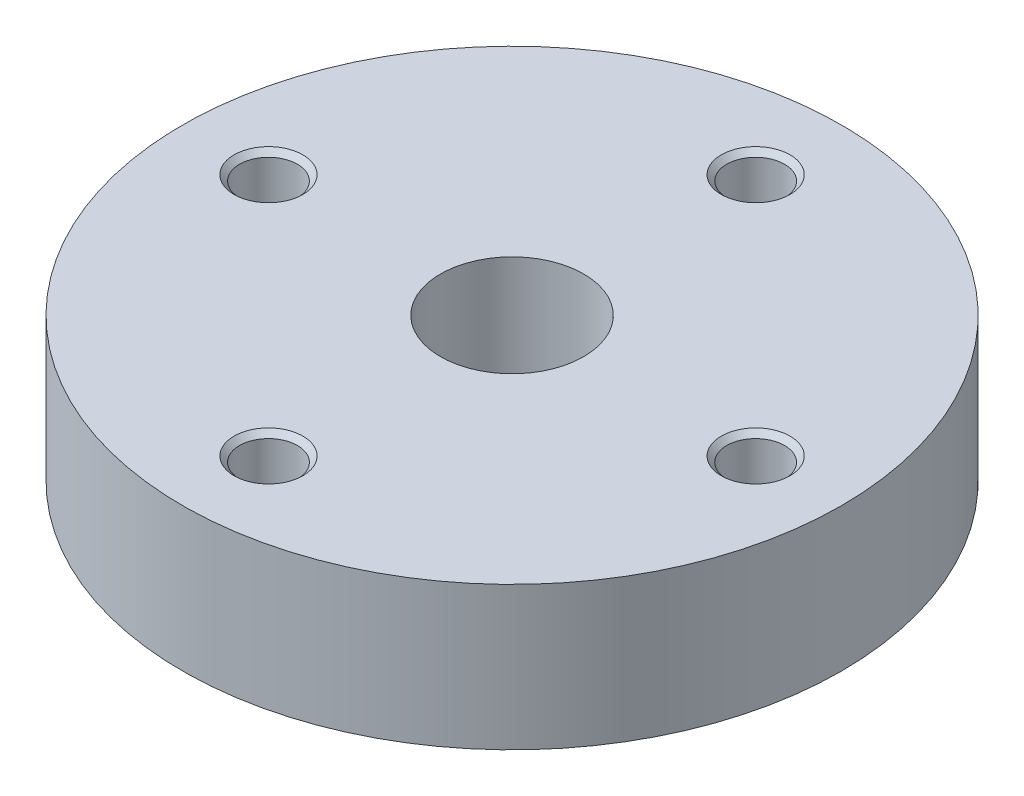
ISO-10303-21;
HEADER;
FILE_DESCRIPTION(('STEP AP214'),'2;1');
FILE_NAME('part.step','',(''),(''),'','','');
FILE_SCHEMA(('AUTOMOTIVE_DESIGN { 1 0 10303 214 1 1 1 1 }'));
ENDSEC;
DATA;
#1=APPLICATION_CONTEXT('core data for automotive mechanical design processes');
#2=APPLICATION_PROTOCOL_DEFINITION('international standard','automotive_design',2000,#1);
#3=PRODUCT_CONTEXT('',#1,'mechanical');
#4=PRODUCT('Part','Part','',(#3));
#5=PRODUCT_RELATED_PRODUCT_CATEGORY('part','',(#4));
#6=PRODUCT_DEFINITION_FORMATION('','',#4);
#7=PRODUCT_DEFINITION_CONTEXT('part definition',#1,'design');
#8=PRODUCT_DEFINITION('design','',#6,#7);
#9=PRODUCT_DEFINITION_SHAPE('','',#8);
#10=(LENGTH_UNIT() NAMED_UNIT(*) SI_UNIT(.MILLI.,.METRE.));
#11=(NAMED_UNIT(*) PLANE_ANGLE_UNIT() SI_UNIT($,.RADIAN.));
#12=(NAMED_UNIT(*) SI_UNIT($,.STERADIAN.) SOLID_ANGLE_UNIT());
#13=UNCERTAINTY_MEASURE_WITH_UNIT(LENGTH_MEASURE(1.E-05),#10,'distance_accuracy_value','');
#14=(GEOMETRIC_REPRESENTATION_CONTEXT(3) GLOBAL_UNCERTAINTY_ASSIGNED_CONTEXT((#13)) GLOBAL_UNIT_ASSIGNED_CONTEXT((#10,
#11,#12)) REPRESENTATION_CONTEXT('',''));
#15=CARTESIAN_POINT('',(0.,0.,0.));
#16=DIRECTION('',(0.,0.,1.));
#17=DIRECTION('',(1.,0.,0.));
#18=AXIS2_PLACEMENT_3D('',#15,#16,#17);
#19=CARTESIAN_POINT('',(0.,12.5,0.));
#20=DIRECTION('',(0.,-1.,0.));
#21=DIRECTION('',(1.,0.,0.));
#22=AXIS2_PLACEMENT_3D('',#19,#20,#21);
#23=CYLINDRICAL_SURFACE('',#22,57.5);
#24=CARTESIAN_POINT('',(0.,0.,0.));
#25=DIRECTION('',(0.,1.,0.));
#26=DIRECTION('',(1.,0.,0.));
#27=AXIS2_PLACEMENT_3D('',#24,#25,#26);
#28=CIRCLE('',#27,57.5);
#29=CARTESIAN_POINT('',(57.5,0.,0.));
#30=VERTEX_POINT('',#29);
#31=EDGE_CURVE('E9',#30,#30,#28,.T.);
#32=ORIENTED_EDGE('',*,*,#31,.T.);
#33=EDGE_LOOP('',(#32));
#34=FACE_BOUND('',#33,.T.);
#35=CARTESIAN_POINT('',(0.,25.,0.));
#36=DIRECTION('',(0.,1.,0.));
#37=DIRECTION('',(1.,0.,0.));
#38=AXIS2_PLACEMENT_3D('',#35,#36,#37);
#39=CIRCLE('',#38,57.5);
#40=CARTESIAN_POINT('',(57.5,25.,0.));
#41=VERTEX_POINT('',#40);
#42=EDGE_CURVE('E111',#41,#41,#39,.T.);
#43=ORIENTED_EDGE('',*,*,#42,.F.);
#44=EDGE_LOOP('',(#43));
#45=FACE_BOUND('',#44,.T.);
#46=ADVANCED_FACE('F15',(#34,#45),#23,.T.);
#47=CARTESIAN_POINT('',(35.,0.,0.));
#48=DIRECTION('',(0.,-1.,0.));
#49=DIRECTION('',(-1.,0.,0.));
#50=AXIS2_PLACEMENT_3D('',#47,#48,#49);
#51=PLANE('',#50);
#52=CARTESIAN_POINT('',(0.,0.,0.));
#53=DIRECTION('',(0.,1.,0.));
#54=DIRECTION('',(1.,0.,0.));
#55=AXIS2_PLACEMENT_3D('',#52,#53,#54);
#56=CIRCLE('',#55,12.5);
#57=CARTESIAN_POINT('',(12.5,0.,0.));
#58=VERTEX_POINT('',#57);
#59=EDGE_CURVE('E25',#58,#58,#56,.T.);
#60=ORIENTED_EDGE('',*,*,#59,.T.);
#61=EDGE_LOOP('',(#60));
#62=FACE_BOUND('',#61,.T.);
#63=ORIENTED_EDGE('',*,*,#31,.F.);
#64=EDGE_LOOP('',(#63));
#65=FACE_BOUND('',#64,.T.);
#66=ADVANCED_FACE('F203',(#62,#65),#51,.T.);
#67=CARTESIAN_POINT('',(0.,12.5,0.));
#68=DIRECTION('',(0.,-1.,0.));
#69=DIRECTION('',(1.,0.,0.));
#70=AXIS2_PLACEMENT_3D('',#67,#68,#69);
#71=CYLINDRICAL_SURFACE('',#70,12.5);
#72=CARTESIAN_POINT('',(0.,25.,0.));
#73=DIRECTION('',(0.,1.,0.));
#74=DIRECTION('',(1.,0.,0.));
#75=AXIS2_PLACEMENT_3D('',#72,#73,#74);
#76=CIRCLE('',#75,12.5);
#77=CARTESIAN_POINT('',(12.5,25.,0.));
#78=VERTEX_POINT('',#77);
#79=EDGE_CURVE('E107',#78,#78,#76,.T.);
#80=ORIENTED_EDGE('',*,*,#79,.T.);
#81=EDGE_LOOP('',(#80));
#82=FACE_BOUND('',#81,.T.);
#83=ORIENTED_EDGE('',*,*,#59,.F.);
#84=EDGE_LOOP('',(#83));
#85=FACE_BOUND('',#84,.T.);
#86=ADVANCED_FACE('F108',(#82,#85),#71,.F.);
#87=CARTESIAN_POINT('',(35.,25.,0.));
#88=DIRECTION('',(0.,1.,0.));
#89=DIRECTION('',(1.,0.,0.));
#90=AXIS2_PLACEMENT_3D('',#87,#88,#89);
#91=PLANE('',#90);
#92=ORIENTED_EDGE('',*,*,#42,.T.);
#93=EDGE_LOOP('',(#92));
#94=FACE_BOUND('',#93,.T.);
#95=ORIENTED_EDGE('',*,*,#79,.F.);
#96=EDGE_LOOP('',(#95));
#97=FACE_BOUND('',#96,.T.);
#98=CARTESIAN_POINT('',(42.5,25.,0.));
#99=DIRECTION('',(0.,-1.,0.));
#100=DIRECTION('',(1.,0.,0.));
#101=AXIS2_PLACEMENT_3D('',#98,#99,#100);
#102=CIRCLE('',#101,6.);
#103=CARTESIAN_POINT('',(48.5,25.,0.));
#104=VERTEX_POINT('',#103);
#105=EDGE_CURVE('E130',#104,#104,#102,.T.);
#106=ORIENTED_EDGE('',*,*,#105,.T.);
#107=EDGE_LOOP('',(#106));
#108=FACE_BOUND('',#107,.T.);
#109=CARTESIAN_POINT('',(0.,25.,-42.5));
#110=DIRECTION('',(0.,-1.,0.));
#111=DIRECTION('',(0.,0.,-1.));
#112=AXIS2_PLACEMENT_3D('',#109,#110,#111);
#113=CIRCLE('',#112,6.);
#114=CARTESIAN_POINT('',(0.,25.,-48.5));
#115=VERTEX_POINT('',#114);
#116=EDGE_CURVE('E147',#115,#115,#113,.T.);
#117=ORIENTED_EDGE('',*,*,#116,.T.);
#118=EDGE_LOOP('',(#117));
#119=FACE_BOUND('',#118,.T.);
#120=CARTESIAN_POINT('',(-42.5,25.,0.));
#121=DIRECTION('',(0.,-1.,0.));
#122=DIRECTION('',(-1.,0.,0.));
#123=AXIS2_PLACEMENT_3D('',#120,#121,#122);
#124=CIRCLE('',#123,6.);
#125=CARTESIAN_POINT('',(-48.5,25.,0.));
#126=VERTEX_POINT('',#125);
#127=EDGE_CURVE('E146',#126,#126,#124,.T.);
#128=ORIENTED_EDGE('',*,*,#127,.T.);
#129=EDGE_LOOP('',(#128));
#130=FACE_BOUND('',#129,.T.);
#131=CARTESIAN_POINT('',(0.,25.,42.5));
#132=DIRECTION('',(0.,-1.,0.));
#133=DIRECTION('',(0.,0.,1.));
#134=AXIS2_PLACEMENT_3D('',#131,#132,#133);
#135=CIRCLE('',#134,6.);
#136=CARTESIAN_POINT('',(0.,25.,48.5));
#137=VERTEX_POINT('',#136);
#138=EDGE_CURVE('E119',#137,#137,#135,.T.);
#139=ORIENTED_EDGE('',*,*,#138,.T.);
#140=EDGE_LOOP('',(#139));
#141=FACE_BOUND('',#140,.T.);
#142=ADVANCED_FACE('F192',(#94,#97,#108,#119,#130,#141),#91,.T.);
#143=CARTESIAN_POINT('',(42.5,5.54137867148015,0.));
#144=DIRECTION('',(0.,1.,0.));
#145=DIRECTION('',(1.,0.,0.));
#146=AXIS2_PLACEMENT_3D('',#143,#144,#145);
#147=CONICAL_SURFACE('',#146,2.52640625,1.0471975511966);
#148=CARTESIAN_POINT('',(42.5,7.,0.));
#149=DIRECTION('',(0.,-1.,0.));
#150=DIRECTION('',(1.,0.,0.));
#151=AXIS2_PLACEMENT_3D('',#148,#149,#150);
#152=CIRCLE('',#151,5.0528125);
#153=CARTESIAN_POINT('',(47.5528125,7.,0.));
#154=VERTEX_POINT('',#153);
#155=EDGE_CURVE('E112',#154,#154,#152,.T.);
#156=ORIENTED_EDGE('',*,*,#155,.F.);
#157=EDGE_LOOP('',(#156));
#158=FACE_BOUND('',#157,.T.);
#159=CARTESIAN_POINT('',(42.5,4.08275734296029,0.));
#160=VERTEX_POINT('',#159);
#161=VERTEX_LOOP('',#160);
#162=FACE_BOUND('',#161,.T.);
#163=ADVANCED_FACE('F186',(#158,#162),#147,.F.);
#164=CARTESIAN_POINT('',(42.5,9.52640625,0.));
#165=DIRECTION('',(0.,1.,0.));
#166=DIRECTION('',(1.,0.,0.));
#167=AXIS2_PLACEMENT_3D('',#164,#165,#166);
#168=CYLINDRICAL_SURFACE('',#167,5.0528125);
#169=CARTESIAN_POINT('',(42.5,12.0528125,0.));
#170=DIRECTION('',(0.,-1.,0.));
#171=DIRECTION('',(1.,0.,0.));
#172=AXIS2_PLACEMENT_3D('',#169,#170,#171);
#173=CIRCLE('',#172,5.0528125);
#174=CARTESIAN_POINT('',(47.5528125,12.0528125,0.));
#175=VERTEX_POINT('',#174);
#176=EDGE_CURVE('E115',#175,#175,#173,.T.);
#177=ORIENTED_EDGE('',*,*,#176,.F.);
#178=EDGE_LOOP('',(#177));
#179=FACE_BOUND('',#178,.T.);
#180=ORIENTED_EDGE('',*,*,#155,.T.);
#181=EDGE_LOOP('',(#180));
#182=FACE_BOUND('',#181,.T.);
#183=ADVANCED_FACE('F179',(#179,#182),#168,.F.);
#184=CARTESIAN_POINT('',(42.5,12.52640625,0.));
#185=DIRECTION('',(0.,1.,0.));
#186=DIRECTION('',(1.,0.,0.));
#187=AXIS2_PLACEMENT_3D('',#184,#185,#186);
#188=CONICAL_SURFACE('',#187,5.52640625,0.785398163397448);
#189=CARTESIAN_POINT('',(42.5,13.,0.));
#190=DIRECTION('',(0.,-1.,0.));
#191=DIRECTION('',(1.,0.,0.));
#192=AXIS2_PLACEMENT_3D('',#189,#190,#191);
#193=CIRCLE('',#192,6.);
#194=CARTESIAN_POINT('',(48.5,13.,0.));
#195=VERTEX_POINT('',#194);
#196=EDGE_CURVE('E126',#195,#195,#193,.T.);
#197=ORIENTED_EDGE('',*,*,#196,.F.);
#198=EDGE_LOOP('',(#197));
#199=FACE_BOUND('',#198,.T.);
#200=ORIENTED_EDGE('',*,*,#176,.T.);
#201=EDGE_LOOP('',(#200));
#202=FACE_BOUND('',#201,.T.);
#203=ADVANCED_FACE('F176',(#199,#202),#188,.F.);
#204=CARTESIAN_POINT('',(48.02640625,13.,0.));
#205=DIRECTION('',(0.,1.,0.));
#206=DIRECTION('',(-1.,0.,0.));
#207=AXIS2_PLACEMENT_3D('',#204,#205,#206);
#208=PLANE('',#207);
#209=CARTESIAN_POINT('',(42.5,13.,0.));
#210=DIRECTION('',(0.,-1.,0.));
#211=DIRECTION('',(1.,0.,0.));
#212=AXIS2_PLACEMENT_3D('',#209,#210,#211);
#213=CIRCLE('',#212,5.0528125);
#214=CARTESIAN_POINT('',(47.5528125,13.,0.));
#215=VERTEX_POINT('',#214);
#216=EDGE_CURVE('E135',#215,#215,#213,.T.);
#217=ORIENTED_EDGE('',*,*,#216,.F.);
#218=EDGE_LOOP('',(#217));
#219=FACE_BOUND('',#218,.T.);
#220=ORIENTED_EDGE('',*,*,#196,.T.);
#221=EDGE_LOOP('',(#220));
#222=FACE_BOUND('',#221,.T.);
#223=ADVANCED_FACE('F174',(#219,#222),#208,.F.);
#224=CARTESIAN_POINT('',(42.5,18.52640625,0.));
#225=DIRECTION('',(0.,1.,0.));
#226=DIRECTION('',(1.,0.,0.));
#227=AXIS2_PLACEMENT_3D('',#224,#225,#226);
#228=CYLINDRICAL_SURFACE('',#227,5.0528125);
#229=CARTESIAN_POINT('',(42.5,24.0528125,0.));
#230=DIRECTION('',(0.,-1.,0.));
#231=DIRECTION('',(1.,0.,0.));
#232=AXIS2_PLACEMENT_3D('',#229,#230,#231);
#233=CIRCLE('',#232,5.0528125);
#234=CARTESIAN_POINT('',(47.5528125,24.0528125,0.));
#235=VERTEX_POINT('',#234);
#236=EDGE_CURVE('E128',#235,#235,#233,.T.);
#237=ORIENTED_EDGE('',*,*,#236,.F.);
#238=EDGE_LOOP('',(#237));
#239=FACE_BOUND('',#238,.T.);
#240=ORIENTED_EDGE('',*,*,#216,.T.);
#241=EDGE_LOOP('',(#240));
#242=FACE_BOUND('',#241,.T.);
#243=ADVANCED_FACE('F237',(#239,#242),#228,.F.);
#244=CARTESIAN_POINT('',(42.5,24.52640625,0.));
#245=DIRECTION('',(0.,1.,0.));
#246=DIRECTION('',(1.,0.,0.));
#247=AXIS2_PLACEMENT_3D('',#244,#245,#246);
#248=CONICAL_SURFACE('',#247,5.52640625,0.785398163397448);
#249=ORIENTED_EDGE('',*,*,#105,.F.);
#250=EDGE_LOOP('',(#249));
#251=FACE_BOUND('',#250,.T.);
#252=ORIENTED_EDGE('',*,*,#236,.T.);
#253=EDGE_LOOP('',(#252));
#254=FACE_BOUND('',#253,.T.);
#255=ADVANCED_FACE('F256',(#251,#254),#248,.F.);
#256=CARTESIAN_POINT('',(0.,5.54137867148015,-42.5));
#257=DIRECTION('',(0.,1.,0.));
#258=DIRECTION('',(0.,0.,-1.));
#259=AXIS2_PLACEMENT_3D('',#256,#257,#258);
#260=CONICAL_SURFACE('',#259,2.52640625,1.0471975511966);
#261=CARTESIAN_POINT('',(0.,7.,-42.5));
#262=DIRECTION('',(0.,-1.,0.));
#263=DIRECTION('',(0.,0.,-1.));
#264=AXIS2_PLACEMENT_3D('',#261,#262,#263);
#265=CIRCLE('',#264,5.0528125);
#266=CARTESIAN_POINT('',(0.,7.,-47.5528125));
#267=VERTEX_POINT('',#266);
#268=EDGE_CURVE('E131',#267,#267,#265,.T.);
#269=ORIENTED_EDGE('',*,*,#268,.F.);
#270=EDGE_LOOP('',(#269));
#271=FACE_BOUND('',#270,.T.);
#272=CARTESIAN_POINT('',(0.,4.08275734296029,-42.5));
#273=VERTEX_POINT('',#272);
#274=VERTEX_LOOP('',#273);
#275=FACE_BOUND('',#274,.T.);
#276=ADVANCED_FACE('F224',(#271,#275),#260,.F.);
#277=CARTESIAN_POINT('',(0.,9.52640625,-42.5));
#278=DIRECTION('',(0.,1.,0.));
#279=DIRECTION('',(0.,0.,-1.));
#280=AXIS2_PLACEMENT_3D('',#277,#278,#279);
#281=CYLINDRICAL_SURFACE('',#280,5.0528125);
#282=CARTESIAN_POINT('',(0.,12.0528125,-42.5));
#283=DIRECTION('',(0.,-1.,0.));
#284=DIRECTION('',(0.,0.,-1.));
#285=AXIS2_PLACEMENT_3D('',#282,#283,#284);
#286=CIRCLE('',#285,5.0528125);
#287=CARTESIAN_POINT('',(0.,12.0528125,-47.5528125));
#288=VERTEX_POINT('',#287);
#289=EDGE_CURVE('E160',#288,#288,#286,.T.);
#290=ORIENTED_EDGE('',*,*,#289,.F.);
#291=EDGE_LOOP('',(#290));
#292=FACE_BOUND('',#291,.T.);
#293=ORIENTED_EDGE('',*,*,#268,.T.);
#294=EDGE_LOOP('',(#293));
#295=FACE_BOUND('',#294,.T.);
#296=ADVANCED_FACE('F220',(#292,#295),#281,.F.);
#297=CARTESIAN_POINT('',(0.,12.52640625,-42.5));
#298=DIRECTION('',(0.,1.,0.));
#299=DIRECTION('',(0.,0.,-1.));
#300=AXIS2_PLACEMENT_3D('',#297,#298,#299);
#301=CONICAL_SURFACE('',#300,5.52640625,0.785398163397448);
#302=CARTESIAN_POINT('',(0.,13.,-42.5));
#303=DIRECTION('',(0.,-1.,0.));
#304=DIRECTION('',(0.,0.,-1.));
#305=AXIS2_PLACEMENT_3D('',#302,#303,#304);
#306=CIRCLE('',#305,6.);
#307=CARTESIAN_POINT('',(0.,13.,-48.5));
#308=VERTEX_POINT('',#307);
#309=EDGE_CURVE('E151',#308,#308,#306,.T.);
#310=ORIENTED_EDGE('',*,*,#309,.F.);
#311=EDGE_LOOP('',(#310));
#312=FACE_BOUND('',#311,.T.);
#313=ORIENTED_EDGE('',*,*,#289,.T.);
#314=EDGE_LOOP('',(#313));
#315=FACE_BOUND('',#314,.T.);
#316=ADVANCED_FACE('F223',(#312,#315),#301,.F.);
#317=CARTESIAN_POINT('',(0.,13.,-48.02640625));
#318=DIRECTION('',(0.,1.,0.));
#319=DIRECTION('',(0.,0.,1.));
#320=AXIS2_PLACEMENT_3D('',#317,#318,#319);
#321=PLANE('',#320);
#322=CARTESIAN_POINT('',(0.,13.,-42.5));
#323=DIRECTION('',(0.,-1.,0.));
#324=DIRECTION('',(0.,0.,-1.));
#325=AXIS2_PLACEMENT_3D('',#322,#323,#324);
#326=CIRCLE('',#325,5.0528125);
#327=CARTESIAN_POINT('',(0.,13.,-47.5528125));
#328=VERTEX_POINT('',#327);
#329=EDGE_CURVE('E19',#328,#328,#326,.T.);
#330=ORIENTED_EDGE('',*,*,#329,.F.);
#331=EDGE_LOOP('',(#330));
#332=FACE_BOUND('',#331,.T.);
#333=ORIENTED_EDGE('',*,*,#309,.T.);
#334=EDGE_LOOP('',(#333));
#335=FACE_BOUND('',#334,.T.);
#336=ADVANCED_FACE('F218',(#332,#335),#321,.F.);
#337=CARTESIAN_POINT('',(0.,18.52640625,-42.5));
#338=DIRECTION('',(0.,1.,0.));
#339=DIRECTION('',(0.,0.,-1.));
#340=AXIS2_PLACEMENT_3D('',#337,#338,#339);
#341=CYLINDRICAL_SURFACE('',#340,5.0528125);
#342=CARTESIAN_POINT('',(0.,24.0528125,-42.5));
#343=DIRECTION('',(0.,-1.,0.));
#344=DIRECTION('',(0.,0.,-1.));
#345=AXIS2_PLACEMENT_3D('',#342,#343,#344);
#346=CIRCLE('',#345,5.0528125);
#347=CARTESIAN_POINT('',(0.,24.0528125,-47.5528125));
#348=VERTEX_POINT('',#347);
#349=EDGE_CURVE('E148',#348,#348,#346,.T.);
#350=ORIENTED_EDGE('',*,*,#349,.F.);
#351=EDGE_LOOP('',(#350));
#352=FACE_BOUND('',#351,.T.);
#353=ORIENTED_EDGE('',*,*,#329,.T.);
#354=EDGE_LOOP('',(#353));
#355=FACE_BOUND('',#354,.T.);
#356=ADVANCED_FACE('F215',(#352,#355),#341,.F.);
#357=CARTESIAN_POINT('',(0.,24.52640625,-42.5));
#358=DIRECTION('',(0.,1.,0.));
#359=DIRECTION('',(0.,0.,-1.));
#360=AXIS2_PLACEMENT_3D('',#357,#358,#359);
#361=CONICAL_SURFACE('',#360,5.52640625,0.785398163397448);
#362=ORIENTED_EDGE('',*,*,#116,.F.);
#363=EDGE_LOOP('',(#362));
#364=FACE_BOUND('',#363,.T.);
#365=ORIENTED_EDGE('',*,*,#349,.T.);
#366=EDGE_LOOP('',(#365));
#367=FACE_BOUND('',#366,.T.);
#368=ADVANCED_FACE('F17',(#364,#367),#361,.F.);
#369=CARTESIAN_POINT('',(-42.5,5.54137867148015,0.));
#370=DIRECTION('',(0.,1.,0.));
#371=DIRECTION('',(-1.,0.,0.));
#372=AXIS2_PLACEMENT_3D('',#369,#370,#371);
#373=CONICAL_SURFACE('',#372,2.52640625,1.0471975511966);
#374=CARTESIAN_POINT('',(-42.5,7.,0.));
#375=DIRECTION('',(0.,-1.,0.));
#376=DIRECTION('',(-1.,0.,0.));
#377=AXIS2_PLACEMENT_3D('',#374,#375,#376);
#378=CIRCLE('',#377,5.0528125);
#379=CARTESIAN_POINT('',(-47.5528125,7.,0.));
#380=VERTEX_POINT('',#379);
#381=EDGE_CURVE('E123',#380,#380,#378,.T.);
#382=ORIENTED_EDGE('',*,*,#381,.F.);
#383=EDGE_LOOP('',(#382));
#384=FACE_BOUND('',#383,.T.);
#385=CARTESIAN_POINT('',(-42.5,4.08275734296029,0.));
#386=VERTEX_POINT('',#385);
#387=VERTEX_LOOP('',#386);
#388=FACE_BOUND('',#387,.T.);
#389=ADVANCED_FACE('F234',(#384,#388),#373,.F.);
#390=CARTESIAN_POINT('',(-42.5,9.52640625,0.));
#391=DIRECTION('',(0.,1.,0.));
#392=DIRECTION('',(-1.,0.,0.));
#393=AXIS2_PLACEMENT_3D('',#390,#391,#392);
#394=CYLINDRICAL_SURFACE('',#393,5.0528125);
#395=CARTESIAN_POINT('',(-42.5,12.0528125,0.));
#396=DIRECTION('',(0.,-1.,0.));
#397=DIRECTION('',(-1.,0.,0.));
#398=AXIS2_PLACEMENT_3D('',#395,#396,#397);
#399=CIRCLE('',#398,5.0528125);
#400=CARTESIAN_POINT('',(-47.5528125,12.0528125,0.));
#401=VERTEX_POINT('',#400);
#402=EDGE_CURVE('E121',#401,#401,#399,.T.);
#403=ORIENTED_EDGE('',*,*,#402,.F.);
#404=EDGE_LOOP('',(#403));
#405=FACE_BOUND('',#404,.T.);
#406=ORIENTED_EDGE('',*,*,#381,.T.);
#407=EDGE_LOOP('',(#406));
#408=FACE_BOUND('',#407,.T.);
#409=ADVANCED_FACE('F230',(#405,#408),#394,.F.);
#410=CARTESIAN_POINT('',(-42.5,12.52640625,0.));
#411=DIRECTION('',(0.,1.,0.));
#412=DIRECTION('',(-1.,0.,0.));
#413=AXIS2_PLACEMENT_3D('',#410,#411,#412);
#414=CONICAL_SURFACE('',#413,5.52640625,0.785398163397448);
#415=CARTESIAN_POINT('',(-42.5,13.,0.));
#416=DIRECTION('',(0.,-1.,0.));
#417=DIRECTION('',(-1.,0.,0.));
#418=AXIS2_PLACEMENT_3D('',#415,#416,#417);
#419=CIRCLE('',#418,6.);
#420=CARTESIAN_POINT('',(-48.5,13.,0.));
#421=VERTEX_POINT('',#420);
#422=EDGE_CURVE('E124',#421,#421,#419,.T.);
#423=ORIENTED_EDGE('',*,*,#422,.F.);
#424=EDGE_LOOP('',(#423));
#425=FACE_BOUND('',#424,.T.);
#426=ORIENTED_EDGE('',*,*,#402,.T.);
#427=EDGE_LOOP('',(#426));
#428=FACE_BOUND('',#427,.T.);
#429=ADVANCED_FACE('F226',(#425,#428),#414,.F.);
#430=CARTESIAN_POINT('',(-48.02640625,13.,0.));
#431=DIRECTION('',(0.,1.,0.));
#432=DIRECTION('',(1.,0.,0.));
#433=AXIS2_PLACEMENT_3D('',#430,#431,#432);
#434=PLANE('',#433);
#435=CARTESIAN_POINT('',(-42.5,13.,0.));
#436=DIRECTION('',(0.,-1.,0.));
#437=DIRECTION('',(-1.,0.,0.));
#438=AXIS2_PLACEMENT_3D('',#435,#436,#437);
#439=CIRCLE('',#438,5.0528125);
#440=CARTESIAN_POINT('',(-47.5528125,13.,0.));
#441=VERTEX_POINT('',#440);
#442=EDGE_CURVE('E134',#441,#441,#439,.T.);
#443=ORIENTED_EDGE('',*,*,#442,.F.);
#444=EDGE_LOOP('',(#443));
#445=FACE_BOUND('',#444,.T.);
#446=ORIENTED_EDGE('',*,*,#422,.T.);
#447=EDGE_LOOP('',(#446));
#448=FACE_BOUND('',#447,.T.);
#449=ADVANCED_FACE('F229',(#445,#448),#434,.F.);
#450=CARTESIAN_POINT('',(-42.5,18.52640625,0.));
#451=DIRECTION('',(0.,1.,0.));
#452=DIRECTION('',(-1.,0.,0.));
#453=AXIS2_PLACEMENT_3D('',#450,#451,#452);
#454=CYLINDRICAL_SURFACE('',#453,5.0528125);
#455=CARTESIAN_POINT('',(-42.5,24.0528125,0.));
#456=DIRECTION('',(0.,-1.,0.));
#457=DIRECTION('',(-1.,0.,0.));
#458=AXIS2_PLACEMENT_3D('',#455,#456,#457);
#459=CIRCLE('',#458,5.0528125);
#460=CARTESIAN_POINT('',(-47.5528125,24.0528125,0.));
#461=VERTEX_POINT('',#460);
#462=EDGE_CURVE('E158',#461,#461,#459,.T.);
#463=ORIENTED_EDGE('',*,*,#462,.F.);
#464=EDGE_LOOP('',(#463));
#465=FACE_BOUND('',#464,.T.);
#466=ORIENTED_EDGE('',*,*,#442,.T.);
#467=EDGE_LOOP('',(#466));
#468=FACE_BOUND('',#467,.T.);
#469=ADVANCED_FACE('F295',(#465,#468),#454,.F.);
#470=CARTESIAN_POINT('',(-42.5,24.52640625,0.));
#471=DIRECTION('',(0.,1.,0.));
#472=DIRECTION('',(-1.,0.,0.));
#473=AXIS2_PLACEMENT_3D('',#470,#471,#472);
#474=CONICAL_SURFACE('',#473,5.52640625,0.785398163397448);
#475=ORIENTED_EDGE('',*,*,#127,.F.);
#476=EDGE_LOOP('',(#475));
#477=FACE_BOUND('',#476,.T.);
#478=ORIENTED_EDGE('',*,*,#462,.T.);
#479=EDGE_LOOP('',(#478));
#480=FACE_BOUND('',#479,.T.);
#481=ADVANCED_FACE('F213',(#477,#480),#474,.F.);
#482=CARTESIAN_POINT('',(0.,5.54137867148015,42.5));
#483=DIRECTION('',(0.,1.,0.));
#484=DIRECTION('',(0.,0.,1.));
#485=AXIS2_PLACEMENT_3D('',#482,#483,#484);
#486=CONICAL_SURFACE('',#485,2.52640625,1.0471975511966);
#487=CARTESIAN_POINT('',(0.,7.,42.5));
#488=DIRECTION('',(0.,-1.,0.));
#489=DIRECTION('',(0.,0.,1.));
#490=AXIS2_PLACEMENT_3D('',#487,#488,#489);
#491=CIRCLE('',#490,5.0528125);
#492=CARTESIAN_POINT('',(0.,7.,47.5528125));
#493=VERTEX_POINT('',#492);
#494=EDGE_CURVE('E144',#493,#493,#491,.T.);
#495=ORIENTED_EDGE('',*,*,#494,.F.);
#496=EDGE_LOOP('',(#495));
#497=FACE_BOUND('',#496,.T.);
#498=CARTESIAN_POINT('',(0.,4.08275734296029,42.5));
#499=VERTEX_POINT('',#498);
#500=VERTEX_LOOP('',#499);
#501=FACE_BOUND('',#500,.T.);
#502=ADVANCED_FACE('F287',(#497,#501),#486,.F.);
#503=CARTESIAN_POINT('',(0.,9.52640625,42.5));
#504=DIRECTION('',(0.,1.,0.));
#505=DIRECTION('',(0.,0.,1.));
#506=AXIS2_PLACEMENT_3D('',#503,#504,#505);
#507=CYLINDRICAL_SURFACE('',#506,5.0528125);
#508=CARTESIAN_POINT('',(0.,12.0528125,42.5));
#509=DIRECTION('',(0.,-1.,0.));
#510=DIRECTION('',(0.,0.,1.));
#511=AXIS2_PLACEMENT_3D('',#508,#509,#510);
#512=CIRCLE('',#511,5.0528125);
#513=CARTESIAN_POINT('',(0.,12.0528125,47.5528125));
#514=VERTEX_POINT('',#513);
#515=EDGE_CURVE('E141',#514,#514,#512,.T.);
#516=ORIENTED_EDGE('',*,*,#515,.F.);
#517=EDGE_LOOP('',(#516));
#518=FACE_BOUND('',#517,.T.);
#519=ORIENTED_EDGE('',*,*,#494,.T.);
#520=EDGE_LOOP('',(#519));
#521=FACE_BOUND('',#520,.T.);
#522=ADVANCED_FACE('F289',(#518,#521),#507,.F.);
#523=CARTESIAN_POINT('',(0.,12.52640625,42.5));
#524=DIRECTION('',(0.,1.,0.));
#525=DIRECTION('',(0.,0.,1.));
#526=AXIS2_PLACEMENT_3D('',#523,#524,#525);
#527=CONICAL_SURFACE('',#526,5.52640625,0.785398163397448);
#528=CARTESIAN_POINT('',(0.,13.,42.5));
#529=DIRECTION('',(0.,-1.,0.));
#530=DIRECTION('',(0.,0.,1.));
#531=AXIS2_PLACEMENT_3D('',#528,#529,#530);
#532=CIRCLE('',#531,6.);
#533=CARTESIAN_POINT('',(0.,13.,48.5));
#534=VERTEX_POINT('',#533);
#535=EDGE_CURVE('E140',#534,#534,#532,.T.);
#536=ORIENTED_EDGE('',*,*,#535,.F.);
#537=EDGE_LOOP('',(#536));
#538=FACE_BOUND('',#537,.T.);
#539=ORIENTED_EDGE('',*,*,#515,.T.);
#540=EDGE_LOOP('',(#539));
#541=FACE_BOUND('',#540,.T.);
#542=ADVANCED_FACE('F247',(#538,#541),#527,.F.);
#543=CARTESIAN_POINT('',(0.,13.,48.02640625));
#544=DIRECTION('',(0.,1.,0.));
#545=DIRECTION('',(0.,0.,-1.));
#546=AXIS2_PLACEMENT_3D('',#543,#544,#545);
#547=PLANE('',#546);
#548=CARTESIAN_POINT('',(0.,13.,42.5));
#549=DIRECTION('',(0.,-1.,0.));
#550=DIRECTION('',(0.,0.,1.));
#551=AXIS2_PLACEMENT_3D('',#548,#549,#550);
#552=CIRCLE('',#551,5.0528125);
#553=CARTESIAN_POINT('',(0.,13.,47.5528125));
#554=VERTEX_POINT('',#553);
#555=EDGE_CURVE('E138',#554,#554,#552,.T.);
#556=ORIENTED_EDGE('',*,*,#555,.F.);
#557=EDGE_LOOP('',(#556));
#558=FACE_BOUND('',#557,.T.);
#559=ORIENTED_EDGE('',*,*,#535,.T.);
#560=EDGE_LOOP('',(#559));
#561=FACE_BOUND('',#560,.T.);
#562=ADVANCED_FACE('F243',(#558,#561),#547,.F.);
#563=CARTESIAN_POINT('',(0.,18.52640625,42.5));
#564=DIRECTION('',(0.,1.,0.));
#565=DIRECTION('',(0.,0.,1.));
#566=AXIS2_PLACEMENT_3D('',#563,#564,#565);
#567=CYLINDRICAL_SURFACE('',#566,5.0528125);
#568=CARTESIAN_POINT('',(0.,24.0528125,42.5));
#569=DIRECTION('',(0.,-1.,0.));
#570=DIRECTION('',(0.,0.,1.));
#571=AXIS2_PLACEMENT_3D('',#568,#569,#570);
#572=CIRCLE('',#571,5.0528125);
#573=CARTESIAN_POINT('',(0.,24.0528125,47.5528125));
#574=VERTEX_POINT('',#573);
#575=EDGE_CURVE('E166',#574,#574,#572,.T.);
#576=ORIENTED_EDGE('',*,*,#575,.F.);
#577=EDGE_LOOP('',(#576));
#578=FACE_BOUND('',#577,.T.);
#579=ORIENTED_EDGE('',*,*,#555,.T.);
#580=EDGE_LOOP('',(#579));
#581=FACE_BOUND('',#580,.T.);
#582=ADVANCED_FACE('F246',(#578,#581),#567,.F.);
#583=CARTESIAN_POINT('',(0.,24.52640625,42.5));
#584=DIRECTION('',(0.,1.,0.));
#585=DIRECTION('',(0.,0.,1.));
#586=AXIS2_PLACEMENT_3D('',#583,#584,#585);
#587=CONICAL_SURFACE('',#586,5.52640625,0.785398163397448);
#588=ORIENTED_EDGE('',*,*,#138,.F.);
#589=EDGE_LOOP('',(#588));
#590=FACE_BOUND('',#589,.T.);
#591=ORIENTED_EDGE('',*,*,#575,.T.);
#592=EDGE_LOOP('',(#591));
#593=FACE_BOUND('',#592,.T.);
#594=ADVANCED_FACE('F254',(#590,#593),#587,.F.);
#595=CLOSED_SHELL('',(#46,#66,#86,#142,#163,#183,#203,#223,#243,#255,#276,#296,#316,#336,#356,
#368,#389,#409,#429,#449,#469,#481,#502,#522,#542,#562,#582,#594));
#596=MANIFOLD_SOLID_BREP('B1',#595);
#597=ADVANCED_BREP_SHAPE_REPRESENTATION('',(#18,#596),#14);
#598=SHAPE_DEFINITION_REPRESENTATION(#9,#597);
ENDSEC;
END-ISO-10303-21;
